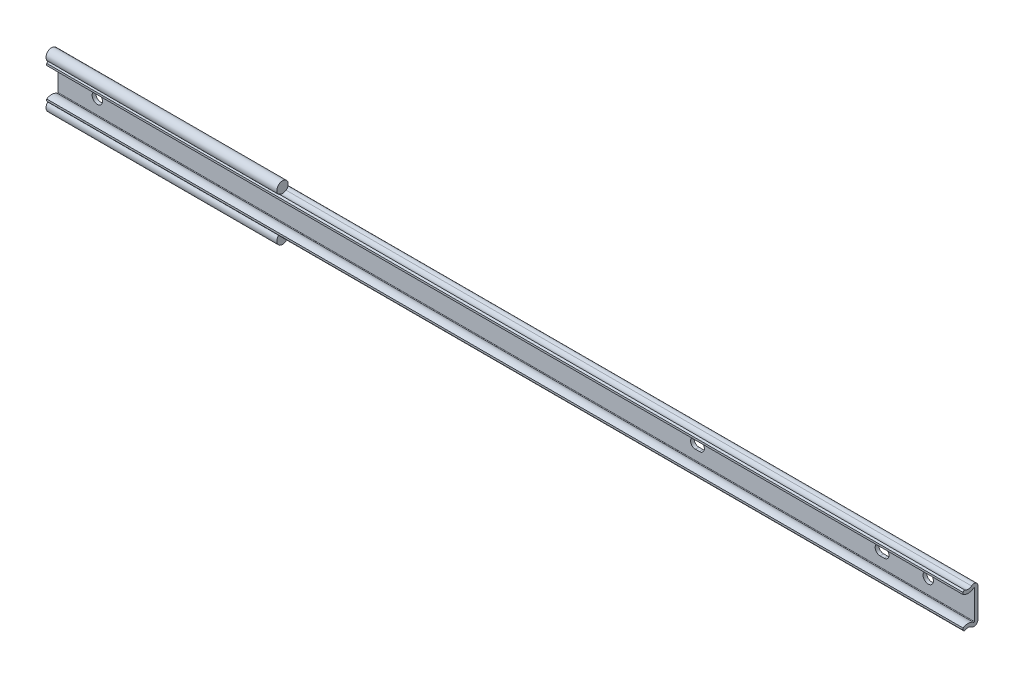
ISO-10303-21;
HEADER;
FILE_DESCRIPTION(('STEP AP214'),'2;1');
FILE_NAME('part.step','',(''),(''),'','','');
FILE_SCHEMA(('AUTOMOTIVE_DESIGN { 1 0 10303 214 1 1 1 1 }'));
ENDSEC;
DATA;
#1=APPLICATION_CONTEXT('core data for automotive mechanical design processes');
#2=APPLICATION_PROTOCOL_DEFINITION('international standard','automotive_design',2000,#1);
#3=PRODUCT_CONTEXT('',#1,'mechanical');
#4=PRODUCT('Part','Part','',(#3));
#5=PRODUCT_RELATED_PRODUCT_CATEGORY('part','',(#4));
#6=PRODUCT_DEFINITION_FORMATION('','',#4);
#7=PRODUCT_DEFINITION_CONTEXT('part definition',#1,'design');
#8=PRODUCT_DEFINITION('design','',#6,#7);
#9=PRODUCT_DEFINITION_SHAPE('','',#8);
#10=(LENGTH_UNIT() NAMED_UNIT(*) SI_UNIT(.MILLI.,.METRE.));
#11=(NAMED_UNIT(*) PLANE_ANGLE_UNIT() SI_UNIT($,.RADIAN.));
#12=(NAMED_UNIT(*) SI_UNIT($,.STERADIAN.) SOLID_ANGLE_UNIT());
#13=UNCERTAINTY_MEASURE_WITH_UNIT(LENGTH_MEASURE(1.E-05),#10,'distance_accuracy_value','');
#14=(GEOMETRIC_REPRESENTATION_CONTEXT(3) GLOBAL_UNCERTAINTY_ASSIGNED_CONTEXT((#13)) GLOBAL_UNIT_ASSIGNED_CONTEXT((#10,
#11,#12)) REPRESENTATION_CONTEXT('',''));
#15=CARTESIAN_POINT('',(0.,0.,0.));
#16=DIRECTION('',(0.,0.,1.));
#17=DIRECTION('',(1.,0.,0.));
#18=AXIS2_PLACEMENT_3D('',#15,#16,#17);
#19=CARTESIAN_POINT('',(380.000104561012,9.670069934,4.309999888));
#20=DIRECTION('',(-1.,0.,0.));
#21=DIRECTION('',(0.,0.,1.));
#22=AXIS2_PLACEMENT_3D('',#19,#20,#21);
#23=CYLINDRICAL_SURFACE('',#22,2.47999999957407);
#24=DIRECTION('',(-1.,0.,0.));
#25=VECTOR('',#24,1.);
#26=CARTESIAN_POINT('',(380.000104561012,7.69580960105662,2.80910144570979));
#27=LINE('',#26,#25);
#28=CARTESIAN_POINT('',(380.,7.69580960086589,2.80910144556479));
#29=VERTEX_POINT('',#28);
#30=CARTESIAN_POINT('',(83.,7.69580960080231,2.80910144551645));
#31=VERTEX_POINT('',#30);
#32=EDGE_CURVE('E376',#29,#31,#27,.T.);
#33=ORIENTED_EDGE('',*,*,#32,.T.);
#34=CARTESIAN_POINT('',(83.,9.670069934,4.309999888));
#35=DIRECTION('',(-1.,0.,0.));
#36=DIRECTION('',(0.,0.,1.));
#37=AXIS2_PLACEMENT_3D('',#34,#35,#36);
#38=CIRCLE('',#37,2.47999999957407);
#39=CARTESIAN_POINT('',(83.,7.77027971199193,5.90411315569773));
#40=VERTEX_POINT('',#39);
#41=EDGE_CURVE('E224',#31,#40,#38,.T.);
#42=ORIENTED_EDGE('',*,*,#41,.T.);
#43=DIRECTION('',(-1.,0.,0.));
#44=VECTOR('',#43,1.);
#45=CARTESIAN_POINT('',(380.000104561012,7.77027971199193,5.90411315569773));
#46=LINE('',#45,#44);
#47=CARTESIAN_POINT('',(380.,7.77027971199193,5.90411315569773));
#48=VERTEX_POINT('',#47);
#49=EDGE_CURVE('E379',#48,#40,#46,.T.);
#50=ORIENTED_EDGE('',*,*,#49,.F.);
#51=CARTESIAN_POINT('',(380.,9.670069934,4.309999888));
#52=DIRECTION('',(1.,0.,0.));
#53=DIRECTION('',(0.,0.,1.));
#54=AXIS2_PLACEMENT_3D('',#51,#52,#53);
#55=CIRCLE('',#54,2.47999999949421);
#56=EDGE_CURVE('E341',#48,#29,#55,.T.);
#57=ORIENTED_EDGE('',*,*,#56,.T.);
#58=EDGE_LOOP('',(#33,#42,#50,#57));
#59=FACE_BOUND('',#58,.T.);
#60=ADVANCED_FACE('F14',(#59),#23,.F.);
#61=CARTESIAN_POINT('',(380.000104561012,6.302682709,1.749999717));
#62=DIRECTION('',(-1.,0.,0.));
#63=DIRECTION('',(0.,0.,1.));
#64=AXIS2_PLACEMENT_3D('',#61,#62,#63);
#65=CYLINDRICAL_SURFACE('',#64,1.74999971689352);
#66=DIRECTION('',(-1.,0.,0.));
#67=VECTOR('',#66,1.);
#68=CARTESIAN_POINT('',(33.,7.94505035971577,2.35425753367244));
#69=LINE('',#68,#67);
#70=CARTESIAN_POINT('',(83.,7.94505035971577,2.35425753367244));
#71=VERTEX_POINT('',#70);
#72=CARTESIAN_POINT('',(-17.,7.94505035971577,2.35425753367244));
#73=VERTEX_POINT('',#72);
#74=EDGE_CURVE('E222',#71,#73,#69,.T.);
#75=ORIENTED_EDGE('',*,*,#74,.F.);
#76=CARTESIAN_POINT('',(83.,6.302682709,1.749999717));
#77=DIRECTION('',(-1.,0.,0.));
#78=DIRECTION('',(0.,0.,1.));
#79=AXIS2_PLACEMENT_3D('',#76,#77,#78);
#80=CIRCLE('',#79,1.74999971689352);
#81=EDGE_CURVE('E227',#71,#31,#80,.F.);
#82=ORIENTED_EDGE('',*,*,#81,.T.);
#83=ORIENTED_EDGE('',*,*,#32,.F.);
#84=CARTESIAN_POINT('',(380.,6.302682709,1.749999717));
#85=DIRECTION('',(-1.,0.,0.));
#86=DIRECTION('',(0.,0.,1.));
#87=AXIS2_PLACEMENT_3D('',#84,#85,#86);
#88=CIRCLE('',#87,1.7499997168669);
#89=CARTESIAN_POINT('',(380.,6.302682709,0.));
#90=VERTEX_POINT('',#89);
#91=EDGE_CURVE('E302',#29,#90,#88,.T.);
#92=ORIENTED_EDGE('',*,*,#91,.T.);
#93=DIRECTION('',(-1.,0.,0.));
#94=VECTOR('',#93,1.);
#95=CARTESIAN_POINT('',(380.000104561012,6.302682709,0.));
#96=LINE('',#95,#94);
#97=CARTESIAN_POINT('',(-17.,6.302682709,0.));
#98=VERTEX_POINT('',#97);
#99=EDGE_CURVE('E372',#90,#98,#96,.T.);
#100=ORIENTED_EDGE('',*,*,#99,.T.);
#101=CARTESIAN_POINT('',(-17.,6.302682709,1.749999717));
#102=DIRECTION('',(-1.,0.,0.));
#103=DIRECTION('',(0.,0.,-1.));
#104=AXIS2_PLACEMENT_3D('',#101,#102,#103);
#105=CIRCLE('',#104,1.74999971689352);
#106=EDGE_CURVE('E362',#73,#98,#105,.T.);
#107=ORIENTED_EDGE('',*,*,#106,.F.);
#108=EDGE_LOOP('',(#75,#82,#83,#92,#100,#107));
#109=FACE_BOUND('',#108,.T.);
#110=ADVANCED_FACE('F422',(#109),#65,.T.);
#111=CARTESIAN_POINT('',(380.000104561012,7.77027971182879,5.90411315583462));
#112=DIRECTION('',(0.,0.642788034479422,0.766044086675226));
#113=DIRECTION('',(0.,-0.766044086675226,0.642788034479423));
#114=AXIS2_PLACEMENT_3D('',#111,#112,#113);
#115=PLANE('',#114);
#116=DIRECTION('',(-1.,0.,0.));
#117=VECTOR('',#116,1.);
#118=CARTESIAN_POINT('',(83.,7.65542986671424,6.00048372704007));
#119=LINE('',#118,#117);
#120=CARTESIAN_POINT('',(-17.,7.65542986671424,6.00048372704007));
#121=VERTEX_POINT('',#120);
#122=CARTESIAN_POINT('',(83.,7.65542986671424,6.00048372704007));
#123=VERTEX_POINT('',#122);
#124=EDGE_CURVE('E218',#121,#123,#119,.F.);
#125=ORIENTED_EDGE('',*,*,#124,.F.);
#126=DIRECTION('',(0.,0.766044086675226,-0.642788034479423));
#127=VECTOR('',#126,1.);
#128=CARTESIAN_POINT('',(-17.,7.77027971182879,5.90411315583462));
#129=LINE('',#128,#127);
#130=CARTESIAN_POINT('',(-17.,7.0958825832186,6.470000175));
#131=VERTEX_POINT('',#130);
#132=EDGE_CURVE('E359',#131,#121,#129,.T.);
#133=ORIENTED_EDGE('',*,*,#132,.F.);
#134=DIRECTION('',(-1.,0.,0.));
#135=VECTOR('',#134,1.);
#136=CARTESIAN_POINT('',(380.000104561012,7.0958825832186,6.470000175));
#137=LINE('',#136,#135);
#138=CARTESIAN_POINT('',(380.,7.0958825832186,6.470000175));
#139=VERTEX_POINT('',#138);
#140=EDGE_CURVE('E382',#139,#131,#137,.T.);
#141=ORIENTED_EDGE('',*,*,#140,.F.);
#142=DIRECTION('',(0.,0.766044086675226,-0.642788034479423));
#143=VECTOR('',#142,1.);
#144=CARTESIAN_POINT('',(380.,7.0958825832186,6.470000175));
#145=LINE('',#144,#143);
#146=EDGE_CURVE('E338',#139,#48,#145,.T.);
#147=ORIENTED_EDGE('',*,*,#146,.T.);
#148=ORIENTED_EDGE('',*,*,#49,.T.);
#149=DIRECTION('',(0.,-0.766044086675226,0.642788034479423));
#150=VECTOR('',#149,1.);
#151=CARTESIAN_POINT('',(83.,7.77027971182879,5.90411315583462));
#152=LINE('',#151,#150);
#153=EDGE_CURVE('E22',#40,#123,#152,.T.);
#154=ORIENTED_EDGE('',*,*,#153,.T.);
#155=EDGE_LOOP('',(#125,#133,#141,#147,#148,#154));
#156=FACE_BOUND('',#155,.T.);
#157=ADVANCED_FACE('F412',(#156),#115,.T.);
#158=CARTESIAN_POINT('',(380.000104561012,7.0958825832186,6.470000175));
#159=DIRECTION('',(0.,-1.79099264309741E-07,0.999999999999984));
#160=DIRECTION('',(0.,-0.999999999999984,-1.79099264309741E-07));
#161=AXIS2_PLACEMENT_3D('',#158,#159,#160);
#162=PLANE('',#161);
#163=DIRECTION('',(-1.,0.,0.));
#164=VECTOR('',#163,1.);
#165=CARTESIAN_POINT('',(380.000104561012,6.26782076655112,6.47000002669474));
#166=LINE('',#165,#164);
#167=CARTESIAN_POINT('',(380.,6.26782076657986,6.47000002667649));
#168=VERTEX_POINT('',#167);
#169=CARTESIAN_POINT('',(-17.,6.26782076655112,6.47000002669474));
#170=VERTEX_POINT('',#169);
#171=EDGE_CURVE('E384',#168,#170,#166,.T.);
#172=ORIENTED_EDGE('',*,*,#171,.F.);
#173=DIRECTION('',(0.,0.999999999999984,1.79099266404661E-07));
#174=VECTOR('',#173,1.);
#175=CARTESIAN_POINT('',(380.,6.26782076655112,6.47000002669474));
#176=LINE('',#175,#174);
#177=EDGE_CURVE('E335',#168,#139,#176,.T.);
#178=ORIENTED_EDGE('',*,*,#177,.T.);
#179=ORIENTED_EDGE('',*,*,#140,.T.);
#180=DIRECTION('',(0.,0.999999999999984,1.79099264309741E-07));
#181=VECTOR('',#180,1.);
#182=CARTESIAN_POINT('',(-17.,7.0958825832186,6.470000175));
#183=LINE('',#182,#181);
#184=EDGE_CURVE('E356',#170,#131,#183,.T.);
#185=ORIENTED_EDGE('',*,*,#184,.F.);
#186=EDGE_LOOP('',(#172,#178,#179,#185));
#187=FACE_BOUND('',#186,.T.);
#188=ADVANCED_FACE('F461',(#187),#162,.T.);
#189=CARTESIAN_POINT('',(380.000104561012,9.670069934,4.309999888));
#190=DIRECTION('',(-1.,0.,0.));
#191=DIRECTION('',(0.,0.,1.));
#192=AXIS2_PLACEMENT_3D('',#189,#190,#191);
#193=CYLINDRICAL_SURFACE('',#192,4.02999999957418);
#194=DIRECTION('',(-1.,0.,0.));
#195=VECTOR('',#194,1.);
#196=CARTESIAN_POINT('',(380.000104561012,6.46189689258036,1.87103991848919));
#197=LINE('',#196,#195);
#198=CARTESIAN_POINT('',(380.,6.46189689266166,1.87103991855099));
#199=VERTEX_POINT('',#198);
#200=CARTESIAN_POINT('',(-17.,6.46189689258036,1.87103991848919));
#201=VERTEX_POINT('',#200);
#202=EDGE_CURVE('E386',#199,#201,#197,.T.);
#203=ORIENTED_EDGE('',*,*,#202,.F.);
#204=CARTESIAN_POINT('',(380.,9.670069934,4.309999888));
#205=DIRECTION('',(-1.,0.,0.));
#206=DIRECTION('',(0.,0.,1.));
#207=AXIS2_PLACEMENT_3D('',#204,#205,#206);
#208=CIRCLE('',#207,4.02999999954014);
#209=EDGE_CURVE('E332',#199,#168,#208,.T.);
#210=ORIENTED_EDGE('',*,*,#209,.T.);
#211=ORIENTED_EDGE('',*,*,#171,.T.);
#212=CARTESIAN_POINT('',(-17.,9.670069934,4.309999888));
#213=DIRECTION('',(-1.,0.,0.));
#214=DIRECTION('',(0.,0.,-1.));
#215=AXIS2_PLACEMENT_3D('',#212,#213,#214);
#216=CIRCLE('',#215,4.02999999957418);
#217=EDGE_CURVE('E353',#201,#170,#216,.T.);
#218=ORIENTED_EDGE('',*,*,#217,.F.);
#219=EDGE_LOOP('',(#203,#210,#211,#218));
#220=FACE_BOUND('',#219,.T.);
#221=ADVANCED_FACE('F464',(#220),#193,.T.);
#222=CARTESIAN_POINT('',(380.000104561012,6.302682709,1.749999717));
#223=DIRECTION('',(-1.,0.,0.));
#224=DIRECTION('',(0.,0.,1.));
#225=AXIS2_PLACEMENT_3D('',#222,#223,#224);
#226=CYLINDRICAL_SURFACE('',#225,0.199999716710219);
#227=DIRECTION('',(-1.,0.,0.));
#228=VECTOR('',#227,1.);
#229=CARTESIAN_POINT('',(380.000104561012,6.302682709,1.55000000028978));
#230=LINE('',#229,#228);
#231=CARTESIAN_POINT('',(380.,6.302682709,1.55000000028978));
#232=VERTEX_POINT('',#231);
#233=CARTESIAN_POINT('',(-17.,6.302682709,1.55000000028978));
#234=VERTEX_POINT('',#233);
#235=EDGE_CURVE('E371',#232,#234,#230,.T.);
#236=ORIENTED_EDGE('',*,*,#235,.F.);
#237=CARTESIAN_POINT('',(380.,6.302682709,1.749999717));
#238=DIRECTION('',(1.,0.,0.));
#239=DIRECTION('',(0.,0.,1.));
#240=AXIS2_PLACEMENT_3D('',#237,#238,#239);
#241=CIRCLE('',#240,0.19999971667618);
#242=EDGE_CURVE('E329',#232,#199,#241,.T.);
#243=ORIENTED_EDGE('',*,*,#242,.T.);
#244=ORIENTED_EDGE('',*,*,#202,.T.);
#245=CARTESIAN_POINT('',(-17.,6.302682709,1.749999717));
#246=DIRECTION('',(1.,0.,0.));
#247=DIRECTION('',(0.,0.,-1.));
#248=AXIS2_PLACEMENT_3D('',#245,#246,#247);
#249=CIRCLE('',#248,0.199999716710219);
#250=EDGE_CURVE('E350',#234,#201,#249,.T.);
#251=ORIENTED_EDGE('',*,*,#250,.F.);
#252=EDGE_LOOP('',(#236,#243,#244,#251));
#253=FACE_BOUND('',#252,.T.);
#254=ADVANCED_FACE('F468',(#253),#226,.F.);
#255=CARTESIAN_POINT('',(380.,-7.095882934,6.46999988));
#256=DIRECTION('',(0.,0.,-1.));
#257=DIRECTION('',(-1.,0.,0.));
#258=AXIS2_PLACEMENT_3D('',#255,#256,#257);
#259=PLANE('',#258);
#260=DIRECTION('',(1.,0.,0.));
#261=VECTOR('',#260,1.);
#262=CARTESIAN_POINT('',(182.3,-7.095882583,6.470000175));
#263=LINE('',#262,#261);
#264=CARTESIAN_POINT('',(-17.,-7.0958825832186,6.470000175));
#265=VERTEX_POINT('',#264);
#266=CARTESIAN_POINT('',(380.,-7.0958825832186,6.470000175));
#267=VERTEX_POINT('',#266);
#268=EDGE_CURVE('E375',#265,#267,#263,.T.);
#269=ORIENTED_EDGE('',*,*,#268,.T.);
#270=DIRECTION('',(0.,0.999999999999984,-1.79099264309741E-07));
#271=VECTOR('',#270,1.);
#272=CARTESIAN_POINT('',(380.,-7.0958825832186,6.470000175));
#273=LINE('',#272,#271);
#274=CARTESIAN_POINT('',(380.,-6.26782076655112,6.47000002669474));
#275=VERTEX_POINT('',#274);
#276=EDGE_CURVE('E317',#267,#275,#273,.T.);
#277=ORIENTED_EDGE('',*,*,#276,.T.);
#278=DIRECTION('',(1.,0.,0.));
#279=VECTOR('',#278,1.);
#280=CARTESIAN_POINT('',(182.3,-6.26782067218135,6.46999987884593));
#281=LINE('',#280,#279);
#282=CARTESIAN_POINT('',(-17.,-6.26782076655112,6.47000002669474));
#283=VERTEX_POINT('',#282);
#284=EDGE_CURVE('E404',#275,#283,#281,.F.);
#285=ORIENTED_EDGE('',*,*,#284,.T.);
#286=DIRECTION('',(0.,0.999999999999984,-1.79099264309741E-07));
#287=VECTOR('',#286,1.);
#288=CARTESIAN_POINT('',(-17.,-7.0958825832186,6.470000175));
#289=LINE('',#288,#287);
#290=EDGE_CURVE('E368',#265,#283,#289,.T.);
#291=ORIENTED_EDGE('',*,*,#290,.F.);
#292=EDGE_LOOP('',(#269,#277,#285,#291));
#293=FACE_BOUND('',#292,.T.);
#294=ADVANCED_FACE('F472',(#293),#259,.F.);
#295=CARTESIAN_POINT('',(-15.4,-7.770279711,5.904113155));
#296=DIRECTION('',(0.,0.642788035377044,-0.766044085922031));
#297=DIRECTION('',(0.,0.766044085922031,0.642788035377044));
#298=AXIS2_PLACEMENT_3D('',#295,#296,#297);
#299=PLANE('',#298);
#300=DIRECTION('',(0.,0.766044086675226,0.642788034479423));
#301=VECTOR('',#300,1.);
#302=CARTESIAN_POINT('',(-17.,-7.77027971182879,5.90411315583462));
#303=LINE('',#302,#301);
#304=CARTESIAN_POINT('',(-17.,-7.65542986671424,6.00048372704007));
#305=VERTEX_POINT('',#304);
#306=EDGE_CURVE('E209',#305,#265,#303,.T.);
#307=ORIENTED_EDGE('',*,*,#306,.F.);
#308=DIRECTION('',(-1.,0.,0.));
#309=VECTOR('',#308,1.);
#310=CARTESIAN_POINT('',(83.,-7.65542986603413,6.00048372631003));
#311=LINE('',#310,#309);
#312=CARTESIAN_POINT('',(83.,-7.65542986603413,6.00048372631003));
#313=VERTEX_POINT('',#312);
#314=EDGE_CURVE('E200',#305,#313,#311,.F.);
#315=ORIENTED_EDGE('',*,*,#314,.T.);
#316=DIRECTION('',(0.,-0.766044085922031,-0.642788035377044));
#317=VECTOR('',#316,1.);
#318=CARTESIAN_POINT('',(83.,-7.770279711,5.904113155));
#319=LINE('',#318,#317);
#320=CARTESIAN_POINT('',(83.,-7.77027971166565,5.90411315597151));
#321=VERTEX_POINT('',#320);
#322=EDGE_CURVE('E187',#313,#321,#319,.T.);
#323=ORIENTED_EDGE('',*,*,#322,.T.);
#324=DIRECTION('',(1.,0.,0.));
#325=VECTOR('',#324,1.);
#326=CARTESIAN_POINT('',(182.3,-7.77027971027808,5.90411315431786));
#327=LINE('',#326,#325);
#328=CARTESIAN_POINT('',(380.,-7.77027971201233,5.90411315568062));
#329=VERTEX_POINT('',#328);
#330=EDGE_CURVE('E402',#329,#321,#327,.F.);
#331=ORIENTED_EDGE('',*,*,#330,.F.);
#332=DIRECTION('',(0.,0.766044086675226,0.642788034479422));
#333=VECTOR('',#332,1.);
#334=CARTESIAN_POINT('',(380.,-7.77027971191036,5.90411315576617));
#335=LINE('',#334,#333);
#336=EDGE_CURVE('E314',#329,#267,#335,.T.);
#337=ORIENTED_EDGE('',*,*,#336,.T.);
#338=ORIENTED_EDGE('',*,*,#268,.F.);
#339=EDGE_LOOP('',(#307,#315,#323,#331,#337,#338));
#340=FACE_BOUND('',#339,.T.);
#341=ADVANCED_FACE('F207',(#340),#299,.F.);
#342=CARTESIAN_POINT('',(380.,-9.670069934,4.309999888));
#343=DIRECTION('',(-1.,0.,0.));
#344=DIRECTION('',(0.,0.,1.));
#345=AXIS2_PLACEMENT_3D('',#342,#343,#344);
#346=CYLINDRICAL_SURFACE('',#345,4.03);
#347=ORIENTED_EDGE('',*,*,#284,.F.);
#348=CARTESIAN_POINT('',(380.,-9.670069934,4.309999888));
#349=DIRECTION('',(-1.,0.,0.));
#350=DIRECTION('',(0.,0.,1.));
#351=AXIS2_PLACEMENT_3D('',#348,#349,#350);
#352=CIRCLE('',#351,4.02999999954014);
#353=CARTESIAN_POINT('',(380.,-6.46189689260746,1.87103991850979));
#354=VERTEX_POINT('',#353);
#355=EDGE_CURVE('E320',#275,#354,#352,.T.);
#356=ORIENTED_EDGE('',*,*,#355,.T.);
#357=DIRECTION('',(-1.,0.,0.));
#358=VECTOR('',#357,1.);
#359=CARTESIAN_POINT('',(182.3,-6.46189676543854,1.87104008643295));
#360=LINE('',#359,#358);
#361=CARTESIAN_POINT('',(-17.,-6.46189689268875,1.87103991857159));
#362=VERTEX_POINT('',#361);
#363=EDGE_CURVE('E401',#362,#354,#360,.F.);
#364=ORIENTED_EDGE('',*,*,#363,.F.);
#365=CARTESIAN_POINT('',(-17.,-9.670069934,4.309999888));
#366=DIRECTION('',(-1.,0.,0.));
#367=DIRECTION('',(0.,0.,1.));
#368=AXIS2_PLACEMENT_3D('',#365,#366,#367);
#369=CIRCLE('',#368,4.02999999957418);
#370=EDGE_CURVE('E344',#283,#362,#369,.T.);
#371=ORIENTED_EDGE('',*,*,#370,.F.);
#372=EDGE_LOOP('',(#347,#356,#364,#371));
#373=FACE_BOUND('',#372,.T.);
#374=ADVANCED_FACE('F486',(#373),#346,.T.);
#375=CARTESIAN_POINT('',(380.,-9.670069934,4.309999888));
#376=DIRECTION('',(-1.,0.,0.));
#377=DIRECTION('',(0.,0.,1.));
#378=AXIS2_PLACEMENT_3D('',#375,#376,#377);
#379=CYLINDRICAL_SURFACE('',#378,2.48);
#380=CARTESIAN_POINT('',(83.,-9.670069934,4.309999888));
#381=DIRECTION('',(1.,0.,0.));
#382=DIRECTION('',(0.,0.,-1.));
#383=AXIS2_PLACEMENT_3D('',#380,#381,#382);
#384=CIRCLE('',#383,2.48);
#385=CARTESIAN_POINT('',(83.,-7.69580960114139,2.80910144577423));
#386=VERTEX_POINT('',#385);
#387=EDGE_CURVE('E192',#386,#321,#384,.T.);
#388=ORIENTED_EDGE('',*,*,#387,.F.);
#389=DIRECTION('',(-1.,0.,0.));
#390=VECTOR('',#389,1.);
#391=CARTESIAN_POINT('',(182.3,-7.69580952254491,2.80910154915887));
#392=LINE('',#391,#390);
#393=CARTESIAN_POINT('',(380.,-7.69580960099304,2.80910144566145));
#394=VERTEX_POINT('',#393);
#395=EDGE_CURVE('E399',#386,#394,#392,.F.);
#396=ORIENTED_EDGE('',*,*,#395,.T.);
#397=CARTESIAN_POINT('',(380.,-9.670069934,4.309999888));
#398=DIRECTION('',(1.,0.,0.));
#399=DIRECTION('',(0.,0.,1.));
#400=AXIS2_PLACEMENT_3D('',#397,#398,#399);
#401=CIRCLE('',#400,2.47999999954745);
#402=EDGE_CURVE('E311',#394,#329,#401,.T.);
#403=ORIENTED_EDGE('',*,*,#402,.T.);
#404=ORIENTED_EDGE('',*,*,#330,.T.);
#405=EDGE_LOOP('',(#388,#396,#403,#404));
#406=FACE_BOUND('',#405,.T.);
#407=ADVANCED_FACE('F482',(#406),#379,.F.);
#408=CARTESIAN_POINT('',(380.,-6.302682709,1.749999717));
#409=DIRECTION('',(-1.,0.,0.));
#410=DIRECTION('',(0.,0.,1.));
#411=AXIS2_PLACEMENT_3D('',#408,#409,#410);
#412=CYLINDRICAL_SURFACE('',#411,0.199999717);
#413=ORIENTED_EDGE('',*,*,#363,.T.);
#414=CARTESIAN_POINT('',(380.,-6.302682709,1.749999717));
#415=DIRECTION('',(1.,0.,0.));
#416=DIRECTION('',(0.,0.,1.));
#417=AXIS2_PLACEMENT_3D('',#414,#415,#416);
#418=CIRCLE('',#417,0.199999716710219);
#419=CARTESIAN_POINT('',(380.,-6.302682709,1.55000000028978));
#420=VERTEX_POINT('',#419);
#421=EDGE_CURVE('E323',#354,#420,#418,.T.);
#422=ORIENTED_EDGE('',*,*,#421,.T.);
#423=DIRECTION('',(-1.,0.,0.));
#424=VECTOR('',#423,1.);
#425=CARTESIAN_POINT('',(181.5,-6.302682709,1.55));
#426=LINE('',#425,#424);
#427=CARTESIAN_POINT('',(-17.,-6.302682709,1.55000000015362));
#428=VERTEX_POINT('',#427);
#429=EDGE_CURVE('E396',#420,#428,#426,.T.);
#430=ORIENTED_EDGE('',*,*,#429,.T.);
#431=CARTESIAN_POINT('',(-17.,-6.302682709,1.749999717));
#432=DIRECTION('',(1.,0.,0.));
#433=DIRECTION('',(0.,0.,1.));
#434=AXIS2_PLACEMENT_3D('',#431,#432,#433);
#435=CIRCLE('',#434,0.199999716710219);
#436=EDGE_CURVE('E347',#362,#428,#435,.T.);
#437=ORIENTED_EDGE('',*,*,#436,.F.);
#438=EDGE_LOOP('',(#413,#422,#430,#437));
#439=FACE_BOUND('',#438,.T.);
#440=ADVANCED_FACE('F478',(#439),#412,.F.);
#441=CARTESIAN_POINT('',(380.,-6.302682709,1.749999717));
#442=DIRECTION('',(-1.,0.,0.));
#443=DIRECTION('',(0.,0.,1.));
#444=AXIS2_PLACEMENT_3D('',#441,#442,#443);
#445=CYLINDRICAL_SURFACE('',#444,1.749999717);
#446=CARTESIAN_POINT('',(83.,-6.302682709,1.749999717));
#447=DIRECTION('',(1.,0.,0.));
#448=DIRECTION('',(0.,0.,-1.));
#449=AXIS2_PLACEMENT_3D('',#446,#447,#448);
#450=CIRCLE('',#449,1.749999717);
#451=CARTESIAN_POINT('',(83.,-7.94505035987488,2.35425753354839));
#452=VERTEX_POINT('',#451);
#453=EDGE_CURVE('E9',#386,#452,#450,.T.);
#454=ORIENTED_EDGE('',*,*,#453,.T.);
#455=DIRECTION('',(-1.,0.,0.));
#456=VECTOR('',#455,1.);
#457=CARTESIAN_POINT('',(33.,-7.94505035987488,2.35425753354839));
#458=LINE('',#457,#456);
#459=CARTESIAN_POINT('',(-17.,-7.94505035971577,2.35425753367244));
#460=VERTEX_POINT('',#459);
#461=EDGE_CURVE('E203',#452,#460,#458,.T.);
#462=ORIENTED_EDGE('',*,*,#461,.T.);
#463=CARTESIAN_POINT('',(-17.,-6.302682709,1.749999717));
#464=DIRECTION('',(-1.,0.,0.));
#465=DIRECTION('',(0.,0.,1.));
#466=AXIS2_PLACEMENT_3D('',#463,#464,#465);
#467=CIRCLE('',#466,1.74999971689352);
#468=CARTESIAN_POINT('',(-17.,-6.302682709,1.06484699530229E-10));
#469=VERTEX_POINT('',#468);
#470=EDGE_CURVE('E364',#469,#460,#467,.T.);
#471=ORIENTED_EDGE('',*,*,#470,.F.);
#472=DIRECTION('',(1.,0.,0.));
#473=VECTOR('',#472,1.);
#474=CARTESIAN_POINT('',(181.5,-6.302682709,0.));
#475=LINE('',#474,#473);
#476=CARTESIAN_POINT('',(380.,-6.302682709,1.06484699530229E-10));
#477=VERTEX_POINT('',#476);
#478=EDGE_CURVE('E392',#469,#477,#475,.T.);
#479=ORIENTED_EDGE('',*,*,#478,.T.);
#480=CARTESIAN_POINT('',(380.,-6.302682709,1.749999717));
#481=DIRECTION('',(-1.,0.,0.));
#482=DIRECTION('',(0.,0.,1.));
#483=AXIS2_PLACEMENT_3D('',#480,#481,#482);
#484=CIRCLE('',#483,1.74999971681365);
#485=EDGE_CURVE('E308',#477,#394,#484,.T.);
#486=ORIENTED_EDGE('',*,*,#485,.T.);
#487=ORIENTED_EDGE('',*,*,#395,.F.);
#488=EDGE_LOOP('',(#454,#462,#471,#479,#486,#487));
#489=FACE_BOUND('',#488,.T.);
#490=ADVANCED_FACE('F474',(#489),#445,.T.);
#491=CARTESIAN_POINT('',(380.,-6.302682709,1.55));
#492=DIRECTION('',(0.,0.,-1.));
#493=DIRECTION('',(-1.,0.,0.));
#494=AXIS2_PLACEMENT_3D('',#491,#492,#493);
#495=PLANE('',#494);
#496=CARTESIAN_POINT('',(360.,0.,1.55));
#497=DIRECTION('',(0.,0.,-1.));
#498=DIRECTION('',(-1.,0.,0.));
#499=AXIS2_PLACEMENT_3D('',#496,#497,#498);
#500=CIRCLE('',#499,2.24999999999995);
#501=CARTESIAN_POINT('',(357.75,0.,1.55));
#502=VERTEX_POINT('',#501);
#503=EDGE_CURVE('E299',#502,#502,#500,.T.);
#504=ORIENTED_EDGE('',*,*,#503,.T.);
#505=EDGE_LOOP('',(#504));
#506=FACE_BOUND('',#505,.T.);
#507=DIRECTION('',(1.,0.,0.));
#508=VECTOR('',#507,1.);
#509=CARTESIAN_POINT('',(380.,2.09999999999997,1.55));
#510=LINE('',#509,#508);
#511=CARTESIAN_POINT('',(259.1,2.1,1.55));
#512=VERTEX_POINT('',#511);
#513=CARTESIAN_POINT('',(260.9,2.1,1.55));
#514=VERTEX_POINT('',#513);
#515=EDGE_CURVE('E293',#512,#514,#510,.T.);
#516=ORIENTED_EDGE('',*,*,#515,.T.);
#517=CARTESIAN_POINT('',(260.9,0.,1.55));
#518=DIRECTION('',(0.,0.,-1.));
#519=DIRECTION('',(-1.,0.,0.));
#520=AXIS2_PLACEMENT_3D('',#517,#518,#519);
#521=CIRCLE('',#520,2.1);
#522=CARTESIAN_POINT('',(260.9,-2.1,1.55));
#523=VERTEX_POINT('',#522);
#524=EDGE_CURVE('E296',#514,#523,#521,.T.);
#525=ORIENTED_EDGE('',*,*,#524,.T.);
#526=DIRECTION('',(-1.,0.,0.));
#527=VECTOR('',#526,1.);
#528=CARTESIAN_POINT('',(380.,-2.10000000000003,1.55));
#529=LINE('',#528,#527);
#530=CARTESIAN_POINT('',(259.1,-2.1,1.55));
#531=VERTEX_POINT('',#530);
#532=EDGE_CURVE('E287',#523,#531,#529,.T.);
#533=ORIENTED_EDGE('',*,*,#532,.T.);
#534=CARTESIAN_POINT('',(259.1,0.,1.55));
#535=DIRECTION('',(0.,0.,-1.));
#536=DIRECTION('',(-1.,0.,0.));
#537=AXIS2_PLACEMENT_3D('',#534,#535,#536);
#538=CIRCLE('',#537,2.1);
#539=EDGE_CURVE('E290',#531,#512,#538,.T.);
#540=ORIENTED_EDGE('',*,*,#539,.T.);
#541=EDGE_LOOP('',(#516,#525,#533,#540));
#542=FACE_BOUND('',#541,.T.);
#543=DIRECTION('',(1.,0.,0.));
#544=VECTOR('',#543,1.);
#545=CARTESIAN_POINT('',(380.,2.1,1.55));
#546=LINE('',#545,#544);
#547=CARTESIAN_POINT('',(339.1,2.1,1.55));
#548=VERTEX_POINT('',#547);
#549=CARTESIAN_POINT('',(340.9,2.1,1.55));
#550=VERTEX_POINT('',#549);
#551=EDGE_CURVE('E281',#548,#550,#546,.T.);
#552=ORIENTED_EDGE('',*,*,#551,.T.);
#553=CARTESIAN_POINT('',(340.9,0.,1.55));
#554=DIRECTION('',(0.,0.,-1.));
#555=DIRECTION('',(-1.,0.,0.));
#556=AXIS2_PLACEMENT_3D('',#553,#554,#555);
#557=CIRCLE('',#556,2.1);
#558=CARTESIAN_POINT('',(340.9,-2.1,1.55));
#559=VERTEX_POINT('',#558);
#560=EDGE_CURVE('E284',#550,#559,#557,.T.);
#561=ORIENTED_EDGE('',*,*,#560,.T.);
#562=DIRECTION('',(-1.,0.,0.));
#563=VECTOR('',#562,1.);
#564=CARTESIAN_POINT('',(380.,-2.1,1.55));
#565=LINE('',#564,#563);
#566=CARTESIAN_POINT('',(339.1,-2.1,1.55));
#567=VERTEX_POINT('',#566);
#568=EDGE_CURVE('E275',#559,#567,#565,.T.);
#569=ORIENTED_EDGE('',*,*,#568,.T.);
#570=CARTESIAN_POINT('',(339.1,0.,1.55));
#571=DIRECTION('',(0.,0.,-1.));
#572=DIRECTION('',(-1.,0.,0.));
#573=AXIS2_PLACEMENT_3D('',#570,#571,#572);
#574=CIRCLE('',#573,2.1);
#575=EDGE_CURVE('E278',#567,#548,#574,.T.);
#576=ORIENTED_EDGE('',*,*,#575,.T.);
#577=EDGE_LOOP('',(#552,#561,#569,#576));
#578=FACE_BOUND('',#577,.T.);
#579=CARTESIAN_POINT('',(0.,0.,1.55));
#580=DIRECTION('',(0.,0.,-1.));
#581=DIRECTION('',(-1.,0.,0.));
#582=AXIS2_PLACEMENT_3D('',#579,#580,#581);
#583=CIRCLE('',#582,2.25);
#584=CARTESIAN_POINT('',(-2.25,0.,1.55));
#585=VERTEX_POINT('',#584);
#586=EDGE_CURVE('E234',#585,#585,#583,.T.);
#587=ORIENTED_EDGE('',*,*,#586,.T.);
#588=EDGE_LOOP('',(#587));
#589=FACE_BOUND('',#588,.T.);
#590=ORIENTED_EDGE('',*,*,#429,.F.);
#591=DIRECTION('',(0.,1.,5.40072709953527E-12));
#592=VECTOR('',#591,1.);
#593=CARTESIAN_POINT('',(380.,-6.302682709,1.5500000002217));
#594=LINE('',#593,#592);
#595=EDGE_CURVE('E326',#420,#232,#594,.T.);
#596=ORIENTED_EDGE('',*,*,#595,.T.);
#597=ORIENTED_EDGE('',*,*,#235,.T.);
#598=DIRECTION('',(0.,1.,0.));
#599=VECTOR('',#598,1.);
#600=CARTESIAN_POINT('',(-17.,-7.02089999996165E-05,1.55));
#601=LINE('',#600,#599);
#602=EDGE_CURVE('E393',#428,#234,#601,.T.);
#603=ORIENTED_EDGE('',*,*,#602,.F.);
#604=EDGE_LOOP('',(#590,#596,#597,#603));
#605=FACE_BOUND('',#604,.T.);
#606=ADVANCED_FACE('F477',(#506,#542,#578,#589,#605),#495,.F.);
#607=CARTESIAN_POINT('',(-17.,6.302682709,0.));
#608=DIRECTION('',(0.,0.,1.));
#609=DIRECTION('',(0.,-1.,0.));
#610=AXIS2_PLACEMENT_3D('',#607,#608,#609);
#611=PLANE('',#610);
#612=CARTESIAN_POINT('',(360.,0.,0.));
#613=DIRECTION('',(0.,0.,-1.));
#614=DIRECTION('',(-1.,0.,0.));
#615=AXIS2_PLACEMENT_3D('',#612,#613,#614);
#616=CIRCLE('',#615,2.24999999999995);
#617=CARTESIAN_POINT('',(357.75,0.,0.));
#618=VERTEX_POINT('',#617);
#619=EDGE_CURVE('E231',#618,#618,#616,.T.);
#620=ORIENTED_EDGE('',*,*,#619,.F.);
#621=EDGE_LOOP('',(#620));
#622=FACE_BOUND('',#621,.T.);
#623=DIRECTION('',(-1.,0.,0.));
#624=VECTOR('',#623,1.);
#625=CARTESIAN_POINT('',(260.9,-2.1,0.));
#626=LINE('',#625,#624);
#627=CARTESIAN_POINT('',(260.9,-2.1,0.));
#628=VERTEX_POINT('',#627);
#629=CARTESIAN_POINT('',(259.1,-2.1,0.));
#630=VERTEX_POINT('',#629);
#631=EDGE_CURVE('E237',#628,#630,#626,.T.);
#632=ORIENTED_EDGE('',*,*,#631,.F.);
#633=CARTESIAN_POINT('',(260.9,0.,0.));
#634=DIRECTION('',(0.,0.,-1.));
#635=DIRECTION('',(-1.,0.,0.));
#636=AXIS2_PLACEMENT_3D('',#633,#634,#635);
#637=CIRCLE('',#636,2.1);
#638=CARTESIAN_POINT('',(260.9,2.1,0.));
#639=VERTEX_POINT('',#638);
#640=EDGE_CURVE('E230',#639,#628,#637,.T.);
#641=ORIENTED_EDGE('',*,*,#640,.F.);
#642=DIRECTION('',(1.,0.,0.));
#643=VECTOR('',#642,1.);
#644=CARTESIAN_POINT('',(260.9,2.1,0.));
#645=LINE('',#644,#643);
#646=CARTESIAN_POINT('',(259.1,2.1,0.));
#647=VERTEX_POINT('',#646);
#648=EDGE_CURVE('E242',#647,#639,#645,.T.);
#649=ORIENTED_EDGE('',*,*,#648,.F.);
#650=CARTESIAN_POINT('',(259.1,0.,0.));
#651=DIRECTION('',(0.,0.,-1.));
#652=DIRECTION('',(-1.,0.,0.));
#653=AXIS2_PLACEMENT_3D('',#650,#651,#652);
#654=CIRCLE('',#653,2.1);
#655=EDGE_CURVE('E239',#630,#647,#654,.T.);
#656=ORIENTED_EDGE('',*,*,#655,.F.);
#657=EDGE_LOOP('',(#632,#641,#649,#656));
#658=FACE_BOUND('',#657,.T.);
#659=DIRECTION('',(-1.,0.,0.));
#660=VECTOR('',#659,1.);
#661=CARTESIAN_POINT('',(340.9,-2.1,0.));
#662=LINE('',#661,#660);
#663=CARTESIAN_POINT('',(340.9,-2.1,0.));
#664=VERTEX_POINT('',#663);
#665=CARTESIAN_POINT('',(339.1,-2.1,0.));
#666=VERTEX_POINT('',#665);
#667=EDGE_CURVE('E258',#664,#666,#662,.T.);
#668=ORIENTED_EDGE('',*,*,#667,.F.);
#669=CARTESIAN_POINT('',(340.9,0.,0.));
#670=DIRECTION('',(0.,0.,-1.));
#671=DIRECTION('',(-1.,0.,0.));
#672=AXIS2_PLACEMENT_3D('',#669,#670,#671);
#673=CIRCLE('',#672,2.1);
#674=CARTESIAN_POINT('',(340.9,2.1,0.));
#675=VERTEX_POINT('',#674);
#676=EDGE_CURVE('E248',#675,#664,#673,.T.);
#677=ORIENTED_EDGE('',*,*,#676,.F.);
#678=DIRECTION('',(1.,0.,0.));
#679=VECTOR('',#678,1.);
#680=CARTESIAN_POINT('',(340.9,2.1,0.));
#681=LINE('',#680,#679);
#682=CARTESIAN_POINT('',(339.1,2.1,0.));
#683=VERTEX_POINT('',#682);
#684=EDGE_CURVE('E263',#683,#675,#681,.T.);
#685=ORIENTED_EDGE('',*,*,#684,.F.);
#686=CARTESIAN_POINT('',(339.1,0.,0.));
#687=DIRECTION('',(0.,0.,-1.));
#688=DIRECTION('',(-1.,0.,0.));
#689=AXIS2_PLACEMENT_3D('',#686,#687,#688);
#690=CIRCLE('',#689,2.1);
#691=EDGE_CURVE('E260',#666,#683,#690,.T.);
#692=ORIENTED_EDGE('',*,*,#691,.F.);
#693=EDGE_LOOP('',(#668,#677,#685,#692));
#694=FACE_BOUND('',#693,.T.);
#695=CARTESIAN_POINT('',(0.,0.,0.));
#696=DIRECTION('',(0.,0.,-1.));
#697=DIRECTION('',(-1.,0.,0.));
#698=AXIS2_PLACEMENT_3D('',#695,#696,#697);
#699=CIRCLE('',#698,2.25);
#700=CARTESIAN_POINT('',(-2.25,0.,0.));
#701=VERTEX_POINT('',#700);
#702=EDGE_CURVE('E235',#701,#701,#699,.T.);
#703=ORIENTED_EDGE('',*,*,#702,.F.);
#704=EDGE_LOOP('',(#703));
#705=FACE_BOUND('',#704,.T.);
#706=ORIENTED_EDGE('',*,*,#99,.F.);
#707=DIRECTION('',(0.,-1.,8.44756942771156E-12));
#708=VECTOR('',#707,1.);
#709=CARTESIAN_POINT('',(380.,6.302682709,0.));
#710=LINE('',#709,#708);
#711=EDGE_CURVE('E305',#90,#477,#710,.T.);
#712=ORIENTED_EDGE('',*,*,#711,.T.);
#713=ORIENTED_EDGE('',*,*,#478,.F.);
#714=DIRECTION('',(0.,-1.,0.));
#715=VECTOR('',#714,1.);
#716=CARTESIAN_POINT('',(-17.,0.,0.));
#717=LINE('',#716,#715);
#718=EDGE_CURVE('E389',#98,#469,#717,.T.);
#719=ORIENTED_EDGE('',*,*,#718,.F.);
#720=EDGE_LOOP('',(#706,#712,#713,#719));
#721=FACE_BOUND('',#720,.T.);
#722=ADVANCED_FACE('F16',(#622,#658,#694,#705,#721),#611,.F.);
#723=CARTESIAN_POINT('',(-17.,-5.603865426,1.55));
#724=DIRECTION('',(1.,0.,0.));
#725=DIRECTION('',(0.,0.,-1.));
#726=AXIS2_PLACEMENT_3D('',#723,#724,#725);
#727=PLANE('',#726);
#728=CARTESIAN_POINT('',(-17.,-9.47,4.31));
#729=DIRECTION('',(-1.,0.,0.));
#730=DIRECTION('',(0.,0.,-1.));
#731=AXIS2_PLACEMENT_3D('',#728,#729,#730);
#732=CIRCLE('',#731,2.48);
#733=EDGE_CURVE('E204',#460,#305,#732,.T.);
#734=ORIENTED_EDGE('',*,*,#733,.T.);
#735=ORIENTED_EDGE('',*,*,#306,.T.);
#736=ORIENTED_EDGE('',*,*,#290,.T.);
#737=ORIENTED_EDGE('',*,*,#370,.T.);
#738=ORIENTED_EDGE('',*,*,#436,.T.);
#739=ORIENTED_EDGE('',*,*,#602,.T.);
#740=ORIENTED_EDGE('',*,*,#250,.T.);
#741=ORIENTED_EDGE('',*,*,#217,.T.);
#742=ORIENTED_EDGE('',*,*,#184,.T.);
#743=ORIENTED_EDGE('',*,*,#132,.T.);
#744=CARTESIAN_POINT('',(-17.,9.47,4.31));
#745=DIRECTION('',(-1.,0.,0.));
#746=DIRECTION('',(0.,0.,1.));
#747=AXIS2_PLACEMENT_3D('',#744,#745,#746);
#748=CIRCLE('',#747,2.48);
#749=EDGE_CURVE('E196',#121,#73,#748,.T.);
#750=ORIENTED_EDGE('',*,*,#749,.T.);
#751=ORIENTED_EDGE('',*,*,#106,.T.);
#752=ORIENTED_EDGE('',*,*,#718,.T.);
#753=ORIENTED_EDGE('',*,*,#470,.T.);
#754=EDGE_LOOP('',(#734,#735,#736,#737,#738,#739,#740,#741,#742,#743,#750,#751,#752,#753));
#755=FACE_BOUND('',#754,.T.);
#756=ADVANCED_FACE('F433',(#755),#727,.F.);
#757=CARTESIAN_POINT('',(380.,6.302682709,1.749999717));
#758=DIRECTION('',(-1.,0.,0.));
#759=DIRECTION('',(0.,0.,1.));
#760=AXIS2_PLACEMENT_3D('',#757,#758,#759);
#761=PLANE('',#760);
#762=ORIENTED_EDGE('',*,*,#91,.F.);
#763=ORIENTED_EDGE('',*,*,#56,.F.);
#764=ORIENTED_EDGE('',*,*,#146,.F.);
#765=ORIENTED_EDGE('',*,*,#177,.F.);
#766=ORIENTED_EDGE('',*,*,#209,.F.);
#767=ORIENTED_EDGE('',*,*,#242,.F.);
#768=ORIENTED_EDGE('',*,*,#595,.F.);
#769=ORIENTED_EDGE('',*,*,#421,.F.);
#770=ORIENTED_EDGE('',*,*,#355,.F.);
#771=ORIENTED_EDGE('',*,*,#276,.F.);
#772=ORIENTED_EDGE('',*,*,#336,.F.);
#773=ORIENTED_EDGE('',*,*,#402,.F.);
#774=ORIENTED_EDGE('',*,*,#485,.F.);
#775=ORIENTED_EDGE('',*,*,#711,.F.);
#776=EDGE_LOOP('',(#762,#763,#764,#765,#766,#767,#768,#769,#770,#771,#772,#773,#774,#775));
#777=FACE_BOUND('',#776,.T.);
#778=ADVANCED_FACE('F425',(#777),#761,.F.);
#779=CARTESIAN_POINT('',(0.,0.,10.));
#780=DIRECTION('',(0.,0.,-1.));
#781=DIRECTION('',(-1.,0.,0.));
#782=AXIS2_PLACEMENT_3D('',#779,#780,#781);
#783=CYLINDRICAL_SURFACE('',#782,2.25);
#784=ORIENTED_EDGE('',*,*,#702,.T.);
#785=EDGE_LOOP('',(#784));
#786=FACE_BOUND('',#785,.T.);
#787=ORIENTED_EDGE('',*,*,#586,.F.);
#788=EDGE_LOOP('',(#787));
#789=FACE_BOUND('',#788,.T.);
#790=ADVANCED_FACE('F527',(#786,#789),#783,.F.);
#791=CARTESIAN_POINT('',(340.9,0.,10.));
#792=DIRECTION('',(0.,0.,-1.));
#793=DIRECTION('',(-1.,0.,0.));
#794=AXIS2_PLACEMENT_3D('',#791,#792,#793);
#795=CYLINDRICAL_SURFACE('',#794,2.1);
#796=DIRECTION('',(0.,0.,-1.));
#797=VECTOR('',#796,1.);
#798=CARTESIAN_POINT('',(340.9,2.1,10.));
#799=LINE('',#798,#797);
#800=EDGE_CURVE('E256',#550,#675,#799,.T.);
#801=ORIENTED_EDGE('',*,*,#800,.T.);
#802=ORIENTED_EDGE('',*,*,#676,.T.);
#803=DIRECTION('',(0.,0.,-1.));
#804=VECTOR('',#803,1.);
#805=CARTESIAN_POINT('',(340.9,-2.1,10.));
#806=LINE('',#805,#804);
#807=EDGE_CURVE('E266',#559,#664,#806,.T.);
#808=ORIENTED_EDGE('',*,*,#807,.F.);
#809=ORIENTED_EDGE('',*,*,#560,.F.);
#810=EDGE_LOOP('',(#801,#802,#808,#809));
#811=FACE_BOUND('',#810,.T.);
#812=ADVANCED_FACE('F529',(#811),#795,.F.);
#813=CARTESIAN_POINT('',(340.9,2.1,10.));
#814=DIRECTION('',(0.,1.,0.));
#815=DIRECTION('',(1.,0.,0.));
#816=AXIS2_PLACEMENT_3D('',#813,#814,#815);
#817=PLANE('',#816);
#818=DIRECTION('',(0.,0.,-1.));
#819=VECTOR('',#818,1.);
#820=CARTESIAN_POINT('',(339.1,2.1,10.));
#821=LINE('',#820,#819);
#822=EDGE_CURVE('E268',#548,#683,#821,.T.);
#823=ORIENTED_EDGE('',*,*,#822,.T.);
#824=ORIENTED_EDGE('',*,*,#684,.T.);
#825=ORIENTED_EDGE('',*,*,#800,.F.);
#826=ORIENTED_EDGE('',*,*,#551,.F.);
#827=EDGE_LOOP('',(#823,#824,#825,#826));
#828=FACE_BOUND('',#827,.T.);
#829=ADVANCED_FACE('F537',(#828),#817,.F.);
#830=CARTESIAN_POINT('',(339.1,0.,10.));
#831=DIRECTION('',(0.,0.,-1.));
#832=DIRECTION('',(-1.,0.,0.));
#833=AXIS2_PLACEMENT_3D('',#830,#831,#832);
#834=CYLINDRICAL_SURFACE('',#833,2.1);
#835=DIRECTION('',(0.,0.,-1.));
#836=VECTOR('',#835,1.);
#837=CARTESIAN_POINT('',(339.1,-2.1,10.));
#838=LINE('',#837,#836);
#839=EDGE_CURVE('E37',#567,#666,#838,.T.);
#840=ORIENTED_EDGE('',*,*,#839,.T.);
#841=ORIENTED_EDGE('',*,*,#691,.T.);
#842=ORIENTED_EDGE('',*,*,#822,.F.);
#843=ORIENTED_EDGE('',*,*,#575,.F.);
#844=EDGE_LOOP('',(#840,#841,#842,#843));
#845=FACE_BOUND('',#844,.T.);
#846=ADVANCED_FACE('F546',(#845),#834,.F.);
#847=CARTESIAN_POINT('',(340.9,-2.1,10.));
#848=DIRECTION('',(0.,-1.,0.));
#849=DIRECTION('',(-1.,0.,0.));
#850=AXIS2_PLACEMENT_3D('',#847,#848,#849);
#851=PLANE('',#850);
#852=ORIENTED_EDGE('',*,*,#807,.T.);
#853=ORIENTED_EDGE('',*,*,#667,.T.);
#854=ORIENTED_EDGE('',*,*,#839,.F.);
#855=ORIENTED_EDGE('',*,*,#568,.F.);
#856=EDGE_LOOP('',(#852,#853,#854,#855));
#857=FACE_BOUND('',#856,.T.);
#858=ADVANCED_FACE('F550',(#857),#851,.F.);
#859=CARTESIAN_POINT('',(260.9,0.,10.));
#860=DIRECTION('',(0.,0.,-1.));
#861=DIRECTION('',(-1.,0.,0.));
#862=AXIS2_PLACEMENT_3D('',#859,#860,#861);
#863=CYLINDRICAL_SURFACE('',#862,2.1);
#864=DIRECTION('',(0.,0.,-1.));
#865=VECTOR('',#864,1.);
#866=CARTESIAN_POINT('',(260.9,2.1,10.));
#867=LINE('',#866,#865);
#868=EDGE_CURVE('E246',#514,#639,#867,.T.);
#869=ORIENTED_EDGE('',*,*,#868,.T.);
#870=ORIENTED_EDGE('',*,*,#640,.T.);
#871=DIRECTION('',(0.,0.,-1.));
#872=VECTOR('',#871,1.);
#873=CARTESIAN_POINT('',(260.9,-2.1,10.));
#874=LINE('',#873,#872);
#875=EDGE_CURVE('E245',#523,#628,#874,.T.);
#876=ORIENTED_EDGE('',*,*,#875,.F.);
#877=ORIENTED_EDGE('',*,*,#524,.F.);
#878=EDGE_LOOP('',(#869,#870,#876,#877));
#879=FACE_BOUND('',#878,.T.);
#880=ADVANCED_FACE('F542',(#879),#863,.F.);
#881=CARTESIAN_POINT('',(260.9,2.1,10.));
#882=DIRECTION('',(0.,1.,0.));
#883=DIRECTION('',(1.,0.,0.));
#884=AXIS2_PLACEMENT_3D('',#881,#882,#883);
#885=PLANE('',#884);
#886=DIRECTION('',(0.,0.,-1.));
#887=VECTOR('',#886,1.);
#888=CARTESIAN_POINT('',(259.1,2.1,10.));
#889=LINE('',#888,#887);
#890=EDGE_CURVE('E249',#512,#647,#889,.T.);
#891=ORIENTED_EDGE('',*,*,#890,.T.);
#892=ORIENTED_EDGE('',*,*,#648,.T.);
#893=ORIENTED_EDGE('',*,*,#868,.F.);
#894=ORIENTED_EDGE('',*,*,#515,.F.);
#895=EDGE_LOOP('',(#891,#892,#893,#894));
#896=FACE_BOUND('',#895,.T.);
#897=ADVANCED_FACE('F557',(#896),#885,.F.);
#898=CARTESIAN_POINT('',(259.1,0.,10.));
#899=DIRECTION('',(0.,0.,-1.));
#900=DIRECTION('',(-1.,0.,0.));
#901=AXIS2_PLACEMENT_3D('',#898,#899,#900);
#902=CYLINDRICAL_SURFACE('',#901,2.1);
#903=DIRECTION('',(0.,0.,-1.));
#904=VECTOR('',#903,1.);
#905=CARTESIAN_POINT('',(259.1,-2.1,10.));
#906=LINE('',#905,#904);
#907=EDGE_CURVE('E29',#531,#630,#906,.T.);
#908=ORIENTED_EDGE('',*,*,#907,.T.);
#909=ORIENTED_EDGE('',*,*,#655,.T.);
#910=ORIENTED_EDGE('',*,*,#890,.F.);
#911=ORIENTED_EDGE('',*,*,#539,.F.);
#912=EDGE_LOOP('',(#908,#909,#910,#911));
#913=FACE_BOUND('',#912,.T.);
#914=ADVANCED_FACE('F573',(#913),#902,.F.);
#915=CARTESIAN_POINT('',(260.9,-2.1,10.));
#916=DIRECTION('',(0.,-1.,0.));
#917=DIRECTION('',(-1.,0.,0.));
#918=AXIS2_PLACEMENT_3D('',#915,#916,#917);
#919=PLANE('',#918);
#920=ORIENTED_EDGE('',*,*,#875,.T.);
#921=ORIENTED_EDGE('',*,*,#631,.T.);
#922=ORIENTED_EDGE('',*,*,#907,.F.);
#923=ORIENTED_EDGE('',*,*,#532,.F.);
#924=EDGE_LOOP('',(#920,#921,#922,#923));
#925=FACE_BOUND('',#924,.T.);
#926=ADVANCED_FACE('F447',(#925),#919,.F.);
#927=CARTESIAN_POINT('',(360.,0.,10.));
#928=DIRECTION('',(0.,0.,-1.));
#929=DIRECTION('',(-1.,0.,0.));
#930=AXIS2_PLACEMENT_3D('',#927,#928,#929);
#931=CYLINDRICAL_SURFACE('',#930,2.24999999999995);
#932=ORIENTED_EDGE('',*,*,#619,.T.);
#933=EDGE_LOOP('',(#932));
#934=FACE_BOUND('',#933,.T.);
#935=ORIENTED_EDGE('',*,*,#503,.F.);
#936=EDGE_LOOP('',(#935));
#937=FACE_BOUND('',#936,.T.);
#938=ADVANCED_FACE('F438',(#934,#937),#931,.F.);
#939=CARTESIAN_POINT('',(83.,9.47,4.31));
#940=DIRECTION('',(-1.,0.,0.));
#941=DIRECTION('',(0.,0.,1.));
#942=AXIS2_PLACEMENT_3D('',#939,#940,#941);
#943=CYLINDRICAL_SURFACE('',#942,2.48);
#944=CARTESIAN_POINT('',(83.,9.47,4.31));
#945=DIRECTION('',(-1.,0.,0.));
#946=DIRECTION('',(0.,0.,1.));
#947=AXIS2_PLACEMENT_3D('',#944,#945,#946);
#948=CIRCLE('',#947,2.48);
#949=EDGE_CURVE('E215',#123,#71,#948,.T.);
#950=ORIENTED_EDGE('',*,*,#949,.T.);
#951=ORIENTED_EDGE('',*,*,#74,.T.);
#952=ORIENTED_EDGE('',*,*,#749,.F.);
#953=ORIENTED_EDGE('',*,*,#124,.T.);
#954=EDGE_LOOP('',(#950,#951,#952,#953));
#955=FACE_BOUND('',#954,.T.);
#956=ADVANCED_FACE('F436',(#955),#943,.T.);
#957=CARTESIAN_POINT('',(83.,9.47,4.31));
#958=DIRECTION('',(-1.,0.,0.));
#959=DIRECTION('',(0.,0.,1.));
#960=AXIS2_PLACEMENT_3D('',#957,#958,#959);
#961=PLANE('',#960);
#962=ORIENTED_EDGE('',*,*,#81,.F.);
#963=ORIENTED_EDGE('',*,*,#949,.F.);
#964=ORIENTED_EDGE('',*,*,#153,.F.);
#965=ORIENTED_EDGE('',*,*,#41,.F.);
#966=EDGE_LOOP('',(#962,#963,#964,#965));
#967=FACE_BOUND('',#966,.T.);
#968=ADVANCED_FACE('F416',(#967),#961,.F.);
#969=CARTESIAN_POINT('',(83.,-9.47,4.31));
#970=DIRECTION('',(-1.,0.,0.));
#971=DIRECTION('',(0.,0.,1.));
#972=AXIS2_PLACEMENT_3D('',#969,#970,#971);
#973=CYLINDRICAL_SURFACE('',#972,2.48);
#974=ORIENTED_EDGE('',*,*,#314,.F.);
#975=ORIENTED_EDGE('',*,*,#733,.F.);
#976=ORIENTED_EDGE('',*,*,#461,.F.);
#977=CARTESIAN_POINT('',(83.,-9.47,4.31));
#978=DIRECTION('',(-1.,0.,0.));
#979=DIRECTION('',(0.,0.,-1.));
#980=AXIS2_PLACEMENT_3D('',#977,#978,#979);
#981=CIRCLE('',#980,2.48);
#982=EDGE_CURVE('E190',#452,#313,#981,.T.);
#983=ORIENTED_EDGE('',*,*,#982,.T.);
#984=EDGE_LOOP('',(#974,#975,#976,#983));
#985=FACE_BOUND('',#984,.T.);
#986=ADVANCED_FACE('F199',(#985),#973,.T.);
#987=CARTESIAN_POINT('',(83.,-9.47,4.31));
#988=DIRECTION('',(1.,0.,0.));
#989=DIRECTION('',(0.,0.,-1.));
#990=AXIS2_PLACEMENT_3D('',#987,#988,#989);
#991=PLANE('',#990);
#992=ORIENTED_EDGE('',*,*,#322,.F.);
#993=ORIENTED_EDGE('',*,*,#982,.F.);
#994=ORIENTED_EDGE('',*,*,#453,.F.);
#995=ORIENTED_EDGE('',*,*,#387,.T.);
#996=EDGE_LOOP('',(#992,#993,#994,#995));
#997=FACE_BOUND('',#996,.T.);
#998=ADVANCED_FACE('F189',(#997),#991,.T.);
#999=CLOSED_SHELL('',(#60,#110,#157,#188,#221,#254,#294,#341,#374,#407,#440,#490,#606,#722,#756,
#778,#790,#812,#829,#846,#858,#880,#897,#914,#926,#938,#956,#968,#986,#998));
#1000=MANIFOLD_SOLID_BREP('B1',#999);
#1001=ADVANCED_BREP_SHAPE_REPRESENTATION('',(#18,#1000),#14);
#1002=SHAPE_DEFINITION_REPRESENTATION(#9,#1001);
ENDSEC;
END-ISO-10303-21;
